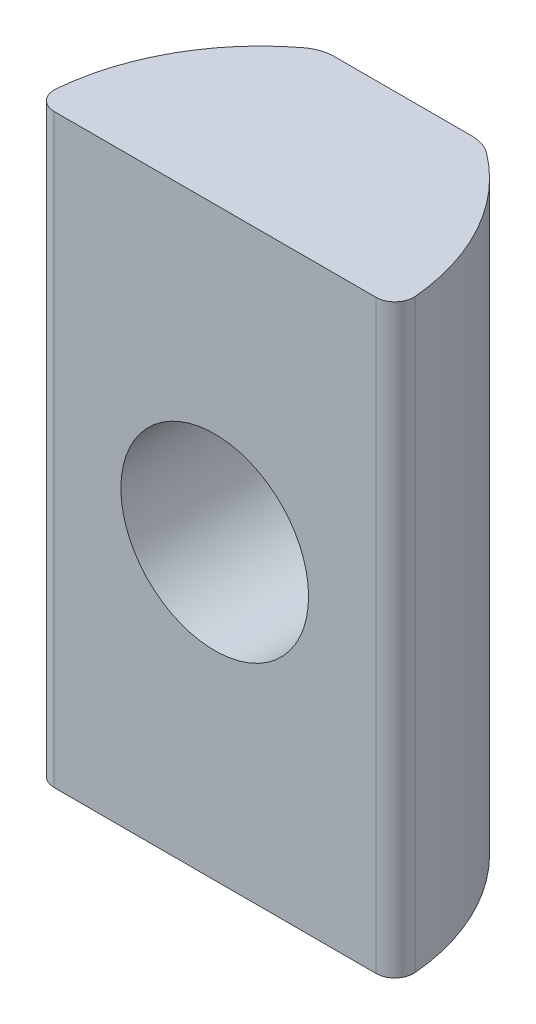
ISO-10303-21;
HEADER;
FILE_DESCRIPTION(('STEP AP214'),'2;1');
FILE_NAME('part.step','',(''),(''),'','','');
FILE_SCHEMA(('AUTOMOTIVE_DESIGN { 1 0 10303 214 1 1 1 1 }'));
ENDSEC;
DATA;
#1=APPLICATION_CONTEXT('core data for automotive mechanical design processes');
#2=APPLICATION_PROTOCOL_DEFINITION('international standard','automotive_design',2000,#1);
#3=PRODUCT_CONTEXT('',#1,'mechanical');
#4=PRODUCT('Part','Part','',(#3));
#5=PRODUCT_RELATED_PRODUCT_CATEGORY('part','',(#4));
#6=PRODUCT_DEFINITION_FORMATION('','',#4);
#7=PRODUCT_DEFINITION_CONTEXT('part definition',#1,'design');
#8=PRODUCT_DEFINITION('design','',#6,#7);
#9=PRODUCT_DEFINITION_SHAPE('','',#8);
#10=(LENGTH_UNIT() NAMED_UNIT(*) SI_UNIT(.MILLI.,.METRE.));
#11=(NAMED_UNIT(*) PLANE_ANGLE_UNIT() SI_UNIT($,.RADIAN.));
#12=(NAMED_UNIT(*) SI_UNIT($,.STERADIAN.) SOLID_ANGLE_UNIT());
#13=UNCERTAINTY_MEASURE_WITH_UNIT(LENGTH_MEASURE(1.E-05),#10,'distance_accuracy_value','');
#14=(GEOMETRIC_REPRESENTATION_CONTEXT(3) GLOBAL_UNCERTAINTY_ASSIGNED_CONTEXT((#13)) GLOBAL_UNIT_ASSIGNED_CONTEXT((#10,
#11,#12)) REPRESENTATION_CONTEXT('',''));
#15=CARTESIAN_POINT('',(0.,0.,0.));
#16=DIRECTION('',(0.,0.,1.));
#17=DIRECTION('',(1.,0.,0.));
#18=AXIS2_PLACEMENT_3D('',#15,#16,#17);
#19=CARTESIAN_POINT('',(1.83064212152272,-7.8,-4.9999999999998));
#20=DIRECTION('',(0.,0.,1.));
#21=DIRECTION('',(1.,0.,0.));
#22=AXIS2_PLACEMENT_3D('',#19,#20,#21);
#23=PLANE('',#22);
#24=DIRECTION('',(0.,1.,0.));
#25=VECTOR('',#24,1.);
#26=CARTESIAN_POINT('',(1.83064212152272,-7.8,-4.99999999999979));
#27=LINE('',#26,#25);
#28=CARTESIAN_POINT('',(1.83064212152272,1.69003615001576,-4.99999999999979));
#29=VERTEX_POINT('',#28);
#30=CARTESIAN_POINT('',(1.83064212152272,7.8,-4.99999999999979));
#31=VERTEX_POINT('',#30);
#32=EDGE_CURVE('E176',#29,#31,#27,.T.);
#33=ORIENTED_EDGE('',*,*,#32,.F.);
#34=CARTESIAN_POINT('',(-0.0115787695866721,0.,-5.));
#35=DIRECTION('',(0.,0.,1.));
#36=DIRECTION('',(1.,0.,0.));
#37=AXIS2_PLACEMENT_3D('',#34,#35,#36);
#38=CIRCLE('',#37,2.5);
#39=CARTESIAN_POINT('',(-1.83064212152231,1.71493688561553,-5.));
#40=VERTEX_POINT('',#39);
#41=EDGE_CURVE('E57',#29,#40,#38,.T.);
#42=ORIENTED_EDGE('',*,*,#41,.T.);
#43=DIRECTION('',(0.,1.,0.));
#44=VECTOR('',#43,1.);
#45=CARTESIAN_POINT('',(-1.83064212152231,-7.8,-4.99999999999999));
#46=LINE('',#45,#44);
#47=CARTESIAN_POINT('',(-1.83064212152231,7.8,-4.99999999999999));
#48=VERTEX_POINT('',#47);
#49=EDGE_CURVE('E180',#40,#48,#46,.T.);
#50=ORIENTED_EDGE('',*,*,#49,.T.);
#51=DIRECTION('',(1.,0.,0.));
#52=VECTOR('',#51,1.);
#53=CARTESIAN_POINT('',(1.83064212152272,7.8,-4.9999999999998));
#54=LINE('',#53,#52);
#55=EDGE_CURVE('E161',#48,#31,#54,.T.);
#56=ORIENTED_EDGE('',*,*,#55,.T.);
#57=EDGE_LOOP('',(#33,#42,#50,#56));
#58=FACE_BOUND('',#57,.T.);
#59=ADVANCED_FACE('F37',(#58),#23,.F.);
#60=CARTESIAN_POINT('',(-1.83064212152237,-7.8,-3.99999999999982));
#61=DIRECTION('',(0.,1.,0.));
#62=DIRECTION('',(0.,0.,1.));
#63=AXIS2_PLACEMENT_3D('',#60,#61,#62);
#64=CYLINDRICAL_SURFACE('',#63,1.00000000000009);
#65=DIRECTION('',(0.,1.,0.));
#66=VECTOR('',#65,1.);
#67=CARTESIAN_POINT('',(-2.43481405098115,-7.8,-4.79685398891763));
#68=LINE('',#67,#66);
#69=CARTESIAN_POINT('',(-2.43481405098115,-7.8,-4.79685398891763));
#70=VERTEX_POINT('',#69);
#71=CARTESIAN_POINT('',(-2.4348140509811,-0.614760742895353,-4.79685398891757));
#72=VERTEX_POINT('',#71);
#73=EDGE_CURVE('E185',#70,#72,#68,.T.);
#74=ORIENTED_EDGE('',*,*,#73,.T.);
#75=CARTESIAN_POINT('',(-2.43481405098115,-0.614760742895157,-4.79685398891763));
#76=CARTESIAN_POINT('',(-2.41708928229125,-0.684571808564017,-4.8102963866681));
#77=CARTESIAN_POINT('',(-2.39644006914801,-0.753361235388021,-4.82502111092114));
#78=CARTESIAN_POINT('',(-2.34934413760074,-0.88883163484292,-4.85541330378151));
#79=CARTESIAN_POINT('',(-2.32288909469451,-0.955509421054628,-4.87108210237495));
#80=CARTESIAN_POINT('',(-2.26503939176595,-1.0848018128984,-4.90129795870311));
#81=CARTESIAN_POINT('',(-2.23378953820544,-1.14747684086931,-4.9158635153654));
#82=CARTESIAN_POINT('',(-2.16594345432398,-1.27028809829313,-4.94281705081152));
#83=CARTESIAN_POINT('',(-2.1293524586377,-1.33042674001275,-4.95520713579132));
#84=CARTESIAN_POINT('',(-2.05198783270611,-1.4461756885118,-4.97599531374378));
#85=CARTESIAN_POINT('',(-2.01136512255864,-1.50186654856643,-4.98449815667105));
#86=CARTESIAN_POINT('',(-1.92484394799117,-1.6106933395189,-4.99651579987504));
#87=CARTESIAN_POINT('',(-1.87888572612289,-1.66378848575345,-4.99996672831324));
#88=CARTESIAN_POINT('',(-1.83064212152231,-1.71493688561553,-4.99999999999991));
#89=B_SPLINE_CURVE_WITH_KNOTS('',3,(#75,#76,#77,#78,#79,#80,#81,#82,#83,#84,#85,#86,#87,#88),
.UNSPECIFIED.,.F.,.F.,(4,2,2,2,2,2,4),(0.,0.219695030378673,0.439707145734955,0.654051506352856,
0.868187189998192,1.0761520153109,1.28672410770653),.UNSPECIFIED.);
#90=CARTESIAN_POINT('',(-1.83064212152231,-1.71493688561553,-5.));
#91=VERTEX_POINT('',#90);
#92=EDGE_CURVE('E155',#72,#91,#89,.T.);
#93=ORIENTED_EDGE('',*,*,#92,.T.);
#94=CARTESIAN_POINT('',(-1.83064212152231,-7.8,-4.99999999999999));
#95=VERTEX_POINT('',#94);
#96=EDGE_CURVE('E181',#95,#91,#46,.T.);
#97=ORIENTED_EDGE('',*,*,#96,.F.);
#98=CARTESIAN_POINT('',(-1.83064212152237,-7.8,-3.99999999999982));
#99=DIRECTION('',(0.,-1.,0.));
#100=DIRECTION('',(0.,0.,-1.));
#101=AXIS2_PLACEMENT_3D('',#98,#99,#100);
#102=CIRCLE('',#101,1.00000000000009);
#103=EDGE_CURVE('E378',#70,#95,#102,.T.);
#104=ORIENTED_EDGE('',*,*,#103,.F.);
#105=EDGE_LOOP('',(#74,#93,#97,#104));
#106=FACE_BOUND('',#105,.T.);
#107=ADVANCED_FACE('F239',(#106),#64,.T.);
#108=CARTESIAN_POINT('',(1.83064212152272,-7.8,-3.99999999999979));
#109=DIRECTION('',(0.,1.,0.));
#110=DIRECTION('',(0.,0.,1.));
#111=AXIS2_PLACEMENT_3D('',#108,#109,#110);
#112=CYLINDRICAL_SURFACE('',#111,1.);
#113=CARTESIAN_POINT('',(1.83064212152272,-7.8,-4.99999999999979));
#114=VERTEX_POINT('',#113);
#115=CARTESIAN_POINT('',(1.83064212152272,-1.69003615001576,-5.));
#116=VERTEX_POINT('',#115);
#117=EDGE_CURVE('E177',#114,#116,#27,.T.);
#118=ORIENTED_EDGE('',*,*,#117,.T.);
#119=CARTESIAN_POINT('',(1.83064212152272,-1.69003615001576,-4.99999999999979));
#120=CARTESIAN_POINT('',(1.86836723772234,-1.64892593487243,-4.99998662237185));
#121=CARTESIAN_POINT('',(1.90466206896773,-1.6065884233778,-4.99786729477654));
#122=CARTESIAN_POINT('',(1.97415147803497,-1.51985071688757,-4.99026775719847));
#123=CARTESIAN_POINT('',(2.00735189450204,-1.47545465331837,-4.98479403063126));
#124=CARTESIAN_POINT('',(2.06997937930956,-1.38566267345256,-4.97145372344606));
#125=CARTESIAN_POINT('',(2.09946452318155,-1.3403000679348,-4.96363290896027));
#126=CARTESIAN_POINT('',(2.15531364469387,-1.24799398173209,-4.94627938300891));
#127=CARTESIAN_POINT('',(2.18167592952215,-1.20104966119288,-4.93674575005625));
#128=CARTESIAN_POINT('',(2.25827231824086,-1.0537491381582,-4.90567890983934));
#129=CARTESIAN_POINT('',(2.30321305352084,-0.950937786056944,-4.88239114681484));
#130=CARTESIAN_POINT('',(2.36042419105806,-0.791750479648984,-4.84843258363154));
#131=CARTESIAN_POINT('',(2.37791379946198,-0.737301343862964,-4.83716995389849));
#132=CARTESIAN_POINT('',(2.40917243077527,-0.62708675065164,-4.81587871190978));
#133=CARTESIAN_POINT('',(2.42293986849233,-0.571320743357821,-4.80585062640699));
#134=CARTESIAN_POINT('',(2.43481405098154,-0.514938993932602,-4.79685398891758));
#135=B_SPLINE_CURVE_WITH_KNOTS('',3,(#119,#120,#121,#122,#123,#124,#125,#126,#127,#128,#129,
#130,#131,#132,#133,#134),.UNSPECIFIED.,.F.,.F.,(4,2,2,2,2,2,2,4),(0.,0.167228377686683,
0.334134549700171,0.497977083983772,0.661908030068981,1.00448769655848,1.1792338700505,
1.35405434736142),.UNSPECIFIED.);
#136=CARTESIAN_POINT('',(2.43481405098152,-0.514938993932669,-4.79685398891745));
#137=VERTEX_POINT('',#136);
#138=EDGE_CURVE('E11',#116,#137,#135,.T.);
#139=ORIENTED_EDGE('',*,*,#138,.T.);
#140=DIRECTION('',(0.,1.,0.));
#141=VECTOR('',#140,1.);
#142=CARTESIAN_POINT('',(2.43481405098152,-7.8,-4.79685398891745));
#143=LINE('',#142,#141);
#144=CARTESIAN_POINT('',(2.43481405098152,-7.8,-4.79685398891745));
#145=VERTEX_POINT('',#144);
#146=EDGE_CURVE('E174',#145,#137,#143,.T.);
#147=ORIENTED_EDGE('',*,*,#146,.F.);
#148=CARTESIAN_POINT('',(1.83064212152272,-7.8,-3.99999999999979));
#149=DIRECTION('',(0.,-1.,0.));
#150=DIRECTION('',(0.,0.,-1.));
#151=AXIS2_PLACEMENT_3D('',#148,#149,#150);
#152=CIRCLE('',#151,1.);
#153=EDGE_CURVE('E130',#114,#145,#152,.T.);
#154=ORIENTED_EDGE('',*,*,#153,.F.);
#155=EDGE_LOOP('',(#118,#139,#147,#154));
#156=FACE_BOUND('',#155,.T.);
#157=ADVANCED_FACE('F247',(#156),#112,.T.);
#158=CARTESIAN_POINT('',(-4.28842123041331,-7.8,-0.500000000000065));
#159=DIRECTION('',(0.,1.,0.));
#160=DIRECTION('',(0.,0.,1.));
#161=AXIS2_PLACEMENT_3D('',#158,#159,#160);
#162=CYLINDRICAL_SURFACE('',#161,0.499999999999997);
#163=CARTESIAN_POINT('',(-4.28842123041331,7.8,-0.500000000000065));
#164=DIRECTION('',(0.,-1.,0.));
#165=DIRECTION('',(0.,0.,-1.));
#166=AXIS2_PLACEMENT_3D('',#163,#164,#165);
#167=CIRCLE('',#166,0.499999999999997);
#168=CARTESIAN_POINT('',(-4.28842123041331,7.8,0.));
#169=VERTEX_POINT('',#168);
#170=CARTESIAN_POINT('',(-4.78647929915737,7.8,-0.544024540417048));
#171=VERTEX_POINT('',#170);
#172=EDGE_CURVE('E151',#169,#171,#167,.T.);
#173=ORIENTED_EDGE('',*,*,#172,.T.);
#174=DIRECTION('',(0.,1.,0.));
#175=VECTOR('',#174,1.);
#176=CARTESIAN_POINT('',(-4.78647929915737,-7.8,-0.544024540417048));
#177=LINE('',#176,#175);
#178=CARTESIAN_POINT('',(-4.78647929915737,-7.8,-0.544024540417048));
#179=VERTEX_POINT('',#178);
#180=EDGE_CURVE('E188',#179,#171,#177,.T.);
#181=ORIENTED_EDGE('',*,*,#180,.F.);
#182=CARTESIAN_POINT('',(-4.28842123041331,-7.8,-0.500000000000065));
#183=DIRECTION('',(0.,-1.,0.));
#184=DIRECTION('',(0.,0.,-1.));
#185=AXIS2_PLACEMENT_3D('',#182,#183,#184);
#186=CIRCLE('',#185,0.499999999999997);
#187=CARTESIAN_POINT('',(-4.28842123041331,-7.8,0.));
#188=VERTEX_POINT('',#187);
#189=EDGE_CURVE('E171',#188,#179,#186,.T.);
#190=ORIENTED_EDGE('',*,*,#189,.F.);
#191=DIRECTION('',(0.,1.,0.));
#192=VECTOR('',#191,1.);
#193=CARTESIAN_POINT('',(-4.28842123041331,-7.8,0.));
#194=LINE('',#193,#192);
#195=EDGE_CURVE('E147',#188,#169,#194,.T.);
#196=ORIENTED_EDGE('',*,*,#195,.T.);
#197=EDGE_LOOP('',(#173,#181,#190,#196));
#198=FACE_BOUND('',#197,.T.);
#199=ADVANCED_FACE('F39',(#198),#162,.T.);
#200=CARTESIAN_POINT('',(1.1902175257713,-7.8,-0.015730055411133));
#201=DIRECTION('',(0.,1.,0.));
#202=DIRECTION('',(0.,0.,1.));
#203=AXIS2_PLACEMENT_3D('',#200,#201,#202);
#204=CYLINDRICAL_SURFACE('',#203,6.00000000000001);
#205=CARTESIAN_POINT('',(-2.43481405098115,0.614760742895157,-4.79685398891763));
#206=VERTEX_POINT('',#205);
#207=CARTESIAN_POINT('',(-2.43481405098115,7.8,-4.79685398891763));
#208=VERTEX_POINT('',#207);
#209=EDGE_CURVE('E184',#206,#208,#68,.T.);
#210=ORIENTED_EDGE('',*,*,#209,.F.);
#211=CARTESIAN_POINT('',(-2.4348140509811,0.614760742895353,-4.79685398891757));
#212=CARTESIAN_POINT('',(-2.44876601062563,0.559800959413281,-4.78626965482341));
#213=CARTESIAN_POINT('',(-2.46089401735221,0.504115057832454,-4.77698364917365));
#214=CARTESIAN_POINT('',(-2.48137181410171,0.391638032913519,-4.76121364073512));
#215=CARTESIAN_POINT('',(-2.48971990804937,0.334846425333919,-4.7547308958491));
#216=CARTESIAN_POINT('',(-2.50232880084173,0.222040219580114,-4.74491190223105));
#217=CARTESIAN_POINT('',(-2.50669019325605,0.166043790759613,-4.74149825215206));
#218=CARTESIAN_POINT('',(-2.51163121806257,0.0538149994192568,-4.73762838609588));
#219=CARTESIAN_POINT('',(-2.51221219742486,-0.00241727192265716,-4.73717111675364));
#220=CARTESIAN_POINT('',(-2.50869983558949,-0.151877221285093,-4.73992700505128));
#221=CARTESIAN_POINT('',(-2.50126778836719,-0.245023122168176,-4.74576228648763));
#222=CARTESIAN_POINT('',(-2.48236848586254,-0.384009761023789,-4.76042901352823));
#223=CARTESIAN_POINT('',(-2.47464688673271,-0.430727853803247,-4.76640362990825));
#224=CARTESIAN_POINT('',(-2.45663548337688,-0.523374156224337,-4.78024372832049));
#225=CARTESIAN_POINT('',(-2.44634616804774,-0.569302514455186,-4.78810885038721));
#226=CARTESIAN_POINT('',(-2.4348140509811,-0.614760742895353,-4.79685398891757));
#227=B_SPLINE_CURVE_WITH_KNOTS('',3,(#211,#212,#213,#214,#215,#216,#217,#218,#219,#220,#221,
#222,#223,#224,#225,#226),.UNSPECIFIED.,.F.,.F.,(4,2,2,2,2,2,2,4),(0.,0.173018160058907,
0.346113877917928,0.514710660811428,0.683247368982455,0.963036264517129,1.10612523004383,
1.24918697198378),.UNSPECIFIED.);
#228=EDGE_CURVE('E222',#206,#72,#227,.T.);
#229=ORIENTED_EDGE('',*,*,#228,.T.);
#230=ORIENTED_EDGE('',*,*,#73,.F.);
#231=CARTESIAN_POINT('',(1.1902175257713,-7.8,-0.015730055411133));
#232=DIRECTION('',(0.,-1.,0.));
#233=DIRECTION('',(0.,0.,-1.));
#234=AXIS2_PLACEMENT_3D('',#231,#232,#233);
#235=CIRCLE('',#234,6.00000000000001);
#236=EDGE_CURVE('E108',#179,#70,#235,.T.);
#237=ORIENTED_EDGE('',*,*,#236,.F.);
#238=ORIENTED_EDGE('',*,*,#180,.T.);
#239=CARTESIAN_POINT('',(1.1902175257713,7.8,-0.015730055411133));
#240=DIRECTION('',(0.,-1.,0.));
#241=DIRECTION('',(0.,0.,-1.));
#242=AXIS2_PLACEMENT_3D('',#239,#240,#241);
#243=CIRCLE('',#242,6.00000000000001);
#244=EDGE_CURVE('E154',#171,#208,#243,.T.);
#245=ORIENTED_EDGE('',*,*,#244,.T.);
#246=EDGE_LOOP('',(#210,#229,#230,#237,#238,#245));
#247=FACE_BOUND('',#246,.T.);
#248=ADVANCED_FACE('F231',(#247),#204,.T.);
#249=ORIENTED_EDGE('',*,*,#49,.F.);
#250=CARTESIAN_POINT('',(-1.83064212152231,1.71493688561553,-4.99999999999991));
#251=CARTESIAN_POINT('',(-1.86831577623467,1.67498530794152,-4.99998781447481));
#252=CARTESIAN_POINT('',(-1.90461305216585,1.63383742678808,-4.99787376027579));
#253=CARTESIAN_POINT('',(-1.97422758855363,1.54951110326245,-4.9902583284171));
#254=CARTESIAN_POINT('',(-2.00755035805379,1.50633665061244,-4.98476336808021));
#255=CARTESIAN_POINT('',(-2.10177355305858,1.3756750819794,-4.96465822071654));
#256=CARTESIAN_POINT('',(-2.1582983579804,1.28558578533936,-4.94636714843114));
#257=CARTESIAN_POINT('',(-2.25788324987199,1.10216314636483,-4.90569439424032));
#258=CARTESIAN_POINT('',(-2.30123604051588,1.00896104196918,-4.88342239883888));
#259=CARTESIAN_POINT('',(-2.35780183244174,0.864847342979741,-4.85005502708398));
#260=CARTESIAN_POINT('',(-2.3753627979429,0.815636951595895,-4.83884054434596));
#261=CARTESIAN_POINT('',(-2.40740780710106,0.716056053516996,-4.8171390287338));
#262=CARTESIAN_POINT('',(-2.42189113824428,0.665685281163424,-4.80665216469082));
#263=CARTESIAN_POINT('',(-2.43481405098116,0.614760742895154,-4.79685398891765));
#264=B_SPLINE_CURVE_WITH_KNOTS('',3,(#250,#251,#252,#253,#254,#255,#256,#257,#258,#259,#260,
#261,#262,#263),.UNSPECIFIED.,.F.,.F.,(4,2,2,2,2,2,4),(0.,0.164555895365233,0.328800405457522,
0.651348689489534,0.966092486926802,1.12631890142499,1.28658237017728),.UNSPECIFIED.);
#265=EDGE_CURVE('E216',#40,#206,#264,.T.);
#266=ORIENTED_EDGE('',*,*,#265,.T.);
#267=ORIENTED_EDGE('',*,*,#209,.T.);
#268=CARTESIAN_POINT('',(-1.83064212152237,7.8,-3.99999999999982));
#269=DIRECTION('',(0.,-1.,0.));
#270=DIRECTION('',(0.,0.,-1.));
#271=AXIS2_PLACEMENT_3D('',#268,#269,#270);
#272=CIRCLE('',#271,1.00000000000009);
#273=EDGE_CURVE('E158',#208,#48,#272,.T.);
#274=ORIENTED_EDGE('',*,*,#273,.T.);
#275=EDGE_LOOP('',(#249,#266,#267,#274));
#276=FACE_BOUND('',#275,.T.);
#277=ADVANCED_FACE('F234',(#276),#64,.T.);
#278=ORIENTED_EDGE('',*,*,#96,.T.);
#279=EDGE_CURVE('E269',#91,#116,#38,.T.);
#280=ORIENTED_EDGE('',*,*,#279,.T.);
#281=ORIENTED_EDGE('',*,*,#117,.F.);
#282=DIRECTION('',(1.,0.,0.));
#283=VECTOR('',#282,1.);
#284=CARTESIAN_POINT('',(1.83064212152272,-7.8,-4.9999999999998));
#285=LINE('',#284,#283);
#286=EDGE_CURVE('E377',#95,#114,#285,.T.);
#287=ORIENTED_EDGE('',*,*,#286,.F.);
#288=EDGE_LOOP('',(#278,#280,#281,#287));
#289=FACE_BOUND('',#288,.T.);
#290=ADVANCED_FACE('F237',(#289),#23,.F.);
#291=CARTESIAN_POINT('',(2.43481405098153,0.514938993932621,-4.79685398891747));
#292=VERTEX_POINT('',#291);
#293=CARTESIAN_POINT('',(2.43481405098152,7.8,-4.79685398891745));
#294=VERTEX_POINT('',#293);
#295=EDGE_CURVE('E142',#292,#294,#143,.T.);
#296=ORIENTED_EDGE('',*,*,#295,.F.);
#297=CARTESIAN_POINT('',(2.43481405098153,0.514938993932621,-4.79685398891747));
#298=CARTESIAN_POINT('',(2.4202646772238,0.584013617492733,-4.80787787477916));
#299=CARTESIAN_POINT('',(2.40286829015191,0.652191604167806,-4.8204521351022));
#300=CARTESIAN_POINT('',(2.36249149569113,0.786593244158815,-4.84718607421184));
#301=CARTESIAN_POINT('',(2.33950874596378,0.852816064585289,-4.86134641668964));
#302=CARTESIAN_POINT('',(2.28871631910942,0.981480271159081,-4.88937514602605));
#303=CARTESIAN_POINT('',(2.26103978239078,1.04397464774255,-4.90324211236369));
#304=CARTESIAN_POINT('',(2.20055464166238,1.16668132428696,-4.92965276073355));
#305=CARTESIAN_POINT('',(2.16774845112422,1.22689468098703,-4.94219706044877));
#306=CARTESIAN_POINT('',(2.08972780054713,1.35697275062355,-4.96689004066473));
#307=CARTESIAN_POINT('',(2.04334920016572,1.42627318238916,-4.97842590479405));
#308=CARTESIAN_POINT('',(1.96807954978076,1.52733565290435,-4.99084316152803));
#309=CARTESIAN_POINT('',(1.94182369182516,1.560777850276,-4.9941738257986));
#310=CARTESIAN_POINT('',(1.88753745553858,1.62639954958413,-4.99875119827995));
#311=CARTESIAN_POINT('',(1.85950505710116,1.65857754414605,-4.99999548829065));
#312=CARTESIAN_POINT('',(1.83064212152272,1.69003615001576,-4.99999999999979));
#313=B_SPLINE_CURVE_WITH_KNOTS('',3,(#297,#298,#299,#300,#301,#302,#303,#304,#305,#306,#307,
#308,#309,#310,#311,#312),.UNSPECIFIED.,.F.,.F.,(4,2,2,2,2,2,2,4),(0.,0.214194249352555,
0.428478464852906,0.637473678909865,0.846370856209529,1.09826287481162,1.2261124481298,
1.3541101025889),.UNSPECIFIED.);
#314=EDGE_CURVE('E50',#292,#29,#313,.T.);
#315=ORIENTED_EDGE('',*,*,#314,.T.);
#316=ORIENTED_EDGE('',*,*,#32,.T.);
#317=CARTESIAN_POINT('',(1.83064212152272,7.8,-3.99999999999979));
#318=DIRECTION('',(0.,-1.,0.));
#319=DIRECTION('',(0.,0.,-1.));
#320=AXIS2_PLACEMENT_3D('',#317,#318,#319);
#321=CIRCLE('',#320,1.);
#322=EDGE_CURVE('E164',#31,#294,#321,.T.);
#323=ORIENTED_EDGE('',*,*,#322,.T.);
#324=EDGE_LOOP('',(#296,#315,#316,#323));
#325=FACE_BOUND('',#324,.T.);
#326=ADVANCED_FACE('F192',(#325),#112,.T.);
#327=CARTESIAN_POINT('',(-1.19021752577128,-7.8,-0.0157300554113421));
#328=DIRECTION('',(0.,1.,0.));
#329=DIRECTION('',(0.,0.,1.));
#330=AXIS2_PLACEMENT_3D('',#327,#328,#329);
#331=CYLINDRICAL_SURFACE('',#330,5.99999999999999);
#332=ORIENTED_EDGE('',*,*,#146,.T.);
#333=CARTESIAN_POINT('',(2.43481405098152,-0.514938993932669,-4.79685398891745));
#334=CARTESIAN_POINT('',(2.44648056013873,-0.459561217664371,-4.78800166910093));
#335=CARTESIAN_POINT('',(2.45629333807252,-0.403566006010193,-4.7805007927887));
#336=CARTESIAN_POINT('',(2.47211275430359,-0.290708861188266,-4.76835608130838));
#337=CARTESIAN_POINT('',(2.47811760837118,-0.233846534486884,-4.76371358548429));
#338=CARTESIAN_POINT('',(2.48612392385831,-0.120909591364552,-4.75751607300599));
#339=CARTESIAN_POINT('',(2.48820909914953,-0.0648445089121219,-4.75589650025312));
#340=CARTESIAN_POINT('',(2.48860250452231,0.0472783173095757,-4.75559112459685));
#341=CARTESIAN_POINT('',(2.48691262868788,0.103336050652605,-4.7569038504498));
#342=CARTESIAN_POINT('',(2.47953737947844,0.218891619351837,-4.76261616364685));
#343=CARTESIAN_POINT('',(2.47358650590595,0.278362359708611,-4.76722083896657));
#344=CARTESIAN_POINT('',(2.45742011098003,0.397106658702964,-4.77963838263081));
#345=CARTESIAN_POINT('',(2.44715511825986,0.456369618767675,-4.78748844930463));
#346=CARTESIAN_POINT('',(2.43481405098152,0.514938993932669,-4.79685398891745));
#347=B_SPLINE_CURVE_WITH_KNOTS('',3,(#333,#334,#335,#336,#337,#338,#339,#340,#341,#342,#343,
#344,#345,#346),.UNSPECIFIED.,.F.,.F.,(4,2,2,2,2,2,4),(0.,0.171812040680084,0.343704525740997,
0.511882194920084,0.679975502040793,0.859571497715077,1.04128572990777),.UNSPECIFIED.);
#348=EDGE_CURVE('E210',#137,#292,#347,.T.);
#349=ORIENTED_EDGE('',*,*,#348,.T.);
#350=ORIENTED_EDGE('',*,*,#295,.T.);
#351=CARTESIAN_POINT('',(-1.19021752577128,7.8,-0.0157300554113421));
#352=DIRECTION('',(0.,-1.,0.));
#353=DIRECTION('',(0.,0.,-1.));
#354=AXIS2_PLACEMENT_3D('',#351,#352,#353);
#355=CIRCLE('',#354,5.99999999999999);
#356=CARTESIAN_POINT('',(4.78647929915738,7.8,-0.544024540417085));
#357=VERTEX_POINT('',#356);
#358=EDGE_CURVE('E139',#294,#357,#355,.T.);
#359=ORIENTED_EDGE('',*,*,#358,.T.);
#360=DIRECTION('',(0.,1.,0.));
#361=VECTOR('',#360,1.);
#362=CARTESIAN_POINT('',(4.78647929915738,-7.8,-0.544024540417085));
#363=LINE('',#362,#361);
#364=CARTESIAN_POINT('',(4.78647929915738,-7.8,-0.544024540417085));
#365=VERTEX_POINT('',#364);
#366=EDGE_CURVE('E136',#365,#357,#363,.T.);
#367=ORIENTED_EDGE('',*,*,#366,.F.);
#368=CARTESIAN_POINT('',(-1.19021752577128,-7.8,-0.0157300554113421));
#369=DIRECTION('',(0.,-1.,0.));
#370=DIRECTION('',(0.,0.,-1.));
#371=AXIS2_PLACEMENT_3D('',#368,#369,#370);
#372=CIRCLE('',#371,5.99999999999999);
#373=EDGE_CURVE('E123',#145,#365,#372,.T.);
#374=ORIENTED_EDGE('',*,*,#373,.F.);
#375=EDGE_LOOP('',(#332,#349,#350,#359,#367,#374));
#376=FACE_BOUND('',#375,.T.);
#377=ADVANCED_FACE('F137',(#376),#331,.T.);
#378=CARTESIAN_POINT('',(4.28842123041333,-7.8,-0.499999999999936));
#379=DIRECTION('',(0.,1.,0.));
#380=DIRECTION('',(0.,0.,1.));
#381=AXIS2_PLACEMENT_3D('',#378,#379,#380);
#382=CYLINDRICAL_SURFACE('',#381,0.499999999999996);
#383=CARTESIAN_POINT('',(4.28842123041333,7.8,-0.499999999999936));
#384=DIRECTION('',(0.,-1.,0.));
#385=DIRECTION('',(0.,0.,-1.));
#386=AXIS2_PLACEMENT_3D('',#383,#384,#385);
#387=CIRCLE('',#386,0.499999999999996);
#388=CARTESIAN_POINT('',(4.28842123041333,7.8,0.));
#389=VERTEX_POINT('',#388);
#390=EDGE_CURVE('E168',#357,#389,#387,.T.);
#391=ORIENTED_EDGE('',*,*,#390,.T.);
#392=DIRECTION('',(0.,1.,0.));
#393=VECTOR('',#392,1.);
#394=CARTESIAN_POINT('',(4.28842123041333,-7.8,0.));
#395=LINE('',#394,#393);
#396=CARTESIAN_POINT('',(4.28842123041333,-7.8,0.));
#397=VERTEX_POINT('',#396);
#398=EDGE_CURVE('E143',#397,#389,#395,.T.);
#399=ORIENTED_EDGE('',*,*,#398,.F.);
#400=CARTESIAN_POINT('',(4.28842123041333,-7.8,-0.499999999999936));
#401=DIRECTION('',(0.,-1.,0.));
#402=DIRECTION('',(0.,0.,-1.));
#403=AXIS2_PLACEMENT_3D('',#400,#401,#402);
#404=CIRCLE('',#403,0.499999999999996);
#405=EDGE_CURVE('E127',#365,#397,#404,.T.);
#406=ORIENTED_EDGE('',*,*,#405,.F.);
#407=ORIENTED_EDGE('',*,*,#366,.T.);
#408=EDGE_LOOP('',(#391,#399,#406,#407));
#409=FACE_BOUND('',#408,.T.);
#410=ADVANCED_FACE('F145',(#409),#382,.T.);
#411=CARTESIAN_POINT('',(-4.28842123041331,-7.8,0.));
#412=DIRECTION('',(0.,0.,-1.));
#413=DIRECTION('',(-1.,0.,0.));
#414=AXIS2_PLACEMENT_3D('',#411,#412,#413);
#415=PLANE('',#414);
#416=CARTESIAN_POINT('',(-0.0115787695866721,0.,0.));
#417=DIRECTION('',(0.,0.,1.));
#418=DIRECTION('',(1.,0.,0.));
#419=AXIS2_PLACEMENT_3D('',#416,#417,#418);
#420=CIRCLE('',#419,2.5);
#421=CARTESIAN_POINT('',(2.48842123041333,0.,0.));
#422=VERTEX_POINT('',#421);
#423=EDGE_CURVE('E271',#422,#422,#420,.T.);
#424=ORIENTED_EDGE('',*,*,#423,.F.);
#425=EDGE_LOOP('',(#424));
#426=FACE_BOUND('',#425,.T.);
#427=DIRECTION('',(-1.,0.,0.));
#428=VECTOR('',#427,1.);
#429=CARTESIAN_POINT('',(-4.28842123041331,7.8,0.));
#430=LINE('',#429,#428);
#431=EDGE_CURVE('E99',#389,#169,#430,.T.);
#432=ORIENTED_EDGE('',*,*,#431,.T.);
#433=ORIENTED_EDGE('',*,*,#195,.F.);
#434=DIRECTION('',(-1.,0.,0.));
#435=VECTOR('',#434,1.);
#436=CARTESIAN_POINT('',(-4.28842123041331,-7.8,0.));
#437=LINE('',#436,#435);
#438=EDGE_CURVE('E66',#397,#188,#437,.T.);
#439=ORIENTED_EDGE('',*,*,#438,.F.);
#440=ORIENTED_EDGE('',*,*,#398,.T.);
#441=EDGE_LOOP('',(#432,#433,#439,#440));
#442=FACE_BOUND('',#441,.T.);
#443=ADVANCED_FACE('F276',(#426,#442),#415,.F.);
#444=CARTESIAN_POINT('',(-4.28842123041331,-7.8,-0.500000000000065));
#445=DIRECTION('',(0.,-1.,0.));
#446=DIRECTION('',(0.,0.,-1.));
#447=AXIS2_PLACEMENT_3D('',#444,#445,#446);
#448=PLANE('',#447);
#449=ORIENTED_EDGE('',*,*,#189,.T.);
#450=ORIENTED_EDGE('',*,*,#236,.T.);
#451=ORIENTED_EDGE('',*,*,#103,.T.);
#452=ORIENTED_EDGE('',*,*,#286,.T.);
#453=ORIENTED_EDGE('',*,*,#153,.T.);
#454=ORIENTED_EDGE('',*,*,#373,.T.);
#455=ORIENTED_EDGE('',*,*,#405,.T.);
#456=ORIENTED_EDGE('',*,*,#438,.T.);
#457=EDGE_LOOP('',(#449,#450,#451,#452,#453,#454,#455,#456));
#458=FACE_BOUND('',#457,.T.);
#459=ADVANCED_FACE('F125',(#458),#448,.T.);
#460=CARTESIAN_POINT('',(-4.28842123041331,7.8,-0.500000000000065));
#461=DIRECTION('',(0.,-1.,0.));
#462=DIRECTION('',(0.,0.,-1.));
#463=AXIS2_PLACEMENT_3D('',#460,#461,#462);
#464=PLANE('',#463);
#465=ORIENTED_EDGE('',*,*,#172,.F.);
#466=ORIENTED_EDGE('',*,*,#431,.F.);
#467=ORIENTED_EDGE('',*,*,#390,.F.);
#468=ORIENTED_EDGE('',*,*,#358,.F.);
#469=ORIENTED_EDGE('',*,*,#322,.F.);
#470=ORIENTED_EDGE('',*,*,#55,.F.);
#471=ORIENTED_EDGE('',*,*,#273,.F.);
#472=ORIENTED_EDGE('',*,*,#244,.F.);
#473=EDGE_LOOP('',(#465,#466,#467,#468,#469,#470,#471,#472));
#474=FACE_BOUND('',#473,.T.);
#475=ADVANCED_FACE('F200',(#474),#464,.F.);
#476=CARTESIAN_POINT('',(-0.0115787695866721,0.,0.));
#477=DIRECTION('',(0.,0.,1.));
#478=DIRECTION('',(1.,0.,0.));
#479=AXIS2_PLACEMENT_3D('',#476,#477,#478);
#480=CYLINDRICAL_SURFACE('',#479,2.5);
#481=ORIENTED_EDGE('',*,*,#423,.T.);
#482=EDGE_LOOP('',(#481));
#483=FACE_BOUND('',#482,.T.);
#484=ORIENTED_EDGE('',*,*,#228,.F.);
#485=ORIENTED_EDGE('',*,*,#265,.F.);
#486=ORIENTED_EDGE('',*,*,#41,.F.);
#487=ORIENTED_EDGE('',*,*,#314,.F.);
#488=ORIENTED_EDGE('',*,*,#348,.F.);
#489=ORIENTED_EDGE('',*,*,#138,.F.);
#490=ORIENTED_EDGE('',*,*,#279,.F.);
#491=ORIENTED_EDGE('',*,*,#92,.F.);
#492=EDGE_LOOP('',(#484,#485,#486,#487,#488,#489,#490,#491));
#493=FACE_BOUND('',#492,.T.);
#494=ADVANCED_FACE('F196',(#483,#493),#480,.F.);
#495=CLOSED_SHELL('',(#59,#107,#157,#199,#248,#277,#290,#326,#377,#410,#443,#459,#475,#494));
#496=MANIFOLD_SOLID_BREP('B2',#495);
#497=ADVANCED_BREP_SHAPE_REPRESENTATION('',(#18,#496),#14);
#498=SHAPE_DEFINITION_REPRESENTATION(#9,#497);
ENDSEC;
END-ISO-10303-21;
